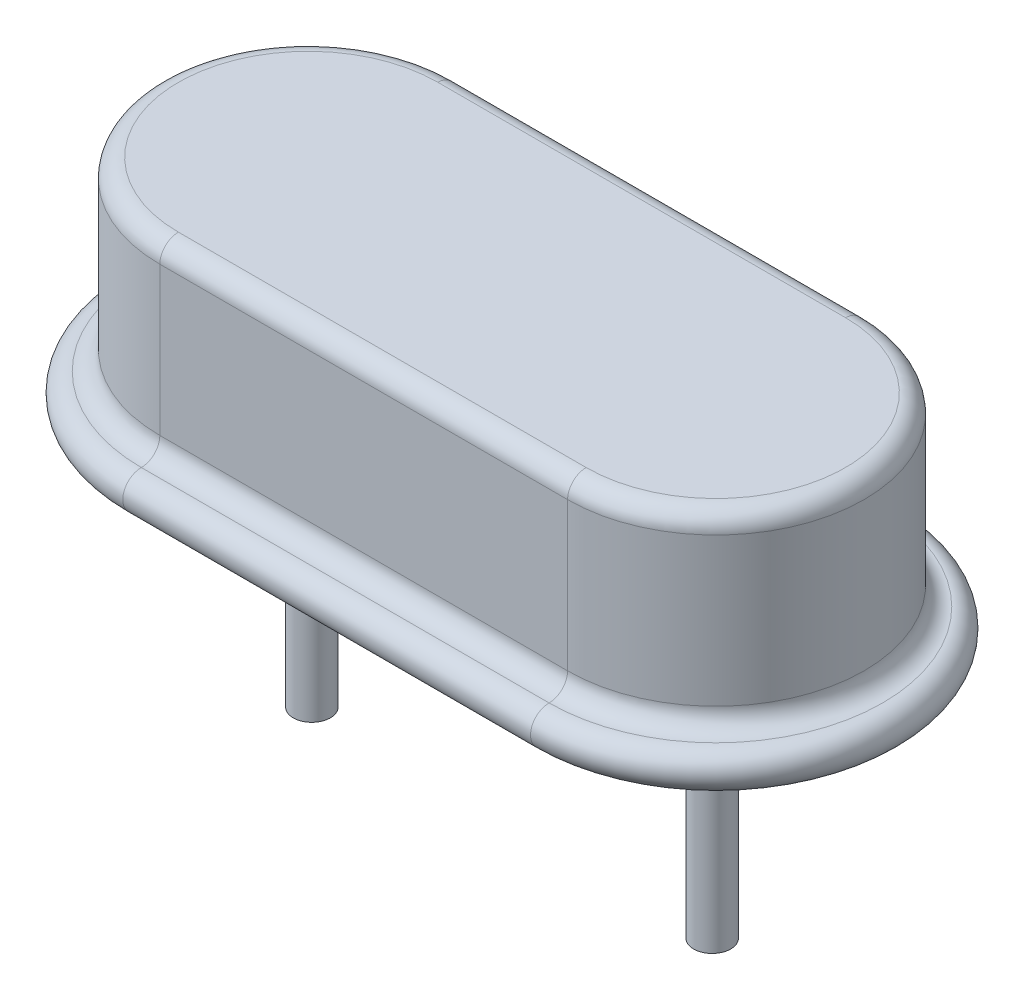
ISO-10303-21;
HEADER;
FILE_DESCRIPTION(('STEP AP214'),'2;1');
FILE_NAME('part.step','',(''),(''),'','','');
FILE_SCHEMA(('AUTOMOTIVE_DESIGN { 1 0 10303 214 1 1 1 1 }'));
ENDSEC;
DATA;
#1=APPLICATION_CONTEXT('core data for automotive mechanical design processes');
#2=APPLICATION_PROTOCOL_DEFINITION('international standard','automotive_design',2000,#1);
#3=PRODUCT_CONTEXT('',#1,'mechanical');
#4=PRODUCT('Part','Part','',(#3));
#5=PRODUCT_RELATED_PRODUCT_CATEGORY('part','',(#4));
#6=PRODUCT_DEFINITION_FORMATION('','',#4);
#7=PRODUCT_DEFINITION_CONTEXT('part definition',#1,'design');
#8=PRODUCT_DEFINITION('design','',#6,#7);
#9=PRODUCT_DEFINITION_SHAPE('','',#8);
#10=(LENGTH_UNIT() NAMED_UNIT(*) SI_UNIT(.MILLI.,.METRE.));
#11=(NAMED_UNIT(*) PLANE_ANGLE_UNIT() SI_UNIT($,.RADIAN.));
#12=(NAMED_UNIT(*) SI_UNIT($,.STERADIAN.) SOLID_ANGLE_UNIT());
#13=UNCERTAINTY_MEASURE_WITH_UNIT(LENGTH_MEASURE(1.E-05),#10,'distance_accuracy_value','');
#14=(GEOMETRIC_REPRESENTATION_CONTEXT(3) GLOBAL_UNCERTAINTY_ASSIGNED_CONTEXT((#13)) GLOBAL_UNIT_ASSIGNED_CONTEXT((#10,
#11,#12)) REPRESENTATION_CONTEXT('',''));
#15=CARTESIAN_POINT('',(0.,0.,0.));
#16=DIRECTION('',(0.,0.,1.));
#17=DIRECTION('',(1.,0.,0.));
#18=AXIS2_PLACEMENT_3D('',#15,#16,#17);
#19=CARTESIAN_POINT('',(0.,3.,0.));
#20=DIRECTION('',(0.,1.,0.));
#21=DIRECTION('',(0.,0.,1.));
#22=AXIS2_PLACEMENT_3D('',#19,#20,#21);
#23=PLANE('',#22);
#24=DIRECTION('',(-1.,0.,0.));
#25=VECTOR('',#24,1.);
#26=CARTESIAN_POINT('',(2.375,3.,-1.75));
#27=LINE('',#26,#25);
#28=CARTESIAN_POINT('',(-2.75,3.,-1.75));
#29=VERTEX_POINT('',#28);
#30=CARTESIAN_POINT('',(2.75,3.,-1.75));
#31=VERTEX_POINT('',#30);
#32=EDGE_CURVE('E112',#29,#31,#27,.F.);
#33=ORIENTED_EDGE('',*,*,#32,.F.);
#34=CARTESIAN_POINT('',(-2.75,3.,0.));
#35=DIRECTION('',(0.,-1.,0.));
#36=DIRECTION('',(0.,0.,1.));
#37=AXIS2_PLACEMENT_3D('',#34,#35,#36);
#38=CIRCLE('',#37,1.75);
#39=CARTESIAN_POINT('',(-2.75,3.,1.75));
#40=VERTEX_POINT('',#39);
#41=EDGE_CURVE('E94',#40,#29,#38,.T.);
#42=ORIENTED_EDGE('',*,*,#41,.F.);
#43=DIRECTION('',(1.,0.,0.));
#44=VECTOR('',#43,1.);
#45=CARTESIAN_POINT('',(-2.375,3.,1.75));
#46=LINE('',#45,#44);
#47=CARTESIAN_POINT('',(2.75,3.,1.75));
#48=VERTEX_POINT('',#47);
#49=EDGE_CURVE('E131',#48,#40,#46,.F.);
#50=ORIENTED_EDGE('',*,*,#49,.F.);
#51=CARTESIAN_POINT('',(2.75,3.,0.));
#52=DIRECTION('',(0.,-1.,0.));
#53=DIRECTION('',(0.,0.,-1.));
#54=AXIS2_PLACEMENT_3D('',#51,#52,#53);
#55=CIRCLE('',#54,1.75);
#56=EDGE_CURVE('E118',#31,#48,#55,.T.);
#57=ORIENTED_EDGE('',*,*,#56,.F.);
#58=EDGE_LOOP('',(#33,#42,#50,#57));
#59=FACE_BOUND('',#58,.T.);
#60=ADVANCED_FACE('F17',(#59),#23,.T.);
#61=CARTESIAN_POINT('',(-2.75,2.75,0.));
#62=DIRECTION('',(0.,-1.,0.));
#63=DIRECTION('',(0.,0.,-1.));
#64=AXIS2_PLACEMENT_3D('',#61,#62,#63);
#65=TOROIDAL_SURFACE('',#64,1.75,0.25);
#66=CARTESIAN_POINT('',(-2.75,2.75,1.75));
#67=DIRECTION('',(1.,0.,0.));
#68=DIRECTION('',(0.,0.,-1.));
#69=AXIS2_PLACEMENT_3D('',#66,#67,#68);
#70=CIRCLE('',#69,0.25);
#71=CARTESIAN_POINT('',(-2.75,2.75,2.));
#72=VERTEX_POINT('',#71);
#73=EDGE_CURVE('E101',#40,#72,#70,.T.);
#74=ORIENTED_EDGE('',*,*,#73,.F.);
#75=ORIENTED_EDGE('',*,*,#41,.T.);
#76=CARTESIAN_POINT('',(-2.75,2.75,-1.75));
#77=DIRECTION('',(-1.,0.,0.));
#78=DIRECTION('',(0.,0.,1.));
#79=AXIS2_PLACEMENT_3D('',#76,#77,#78);
#80=CIRCLE('',#79,0.25);
#81=CARTESIAN_POINT('',(-2.75,2.75,-2.));
#82=VERTEX_POINT('',#81);
#83=EDGE_CURVE('E99',#82,#29,#80,.F.);
#84=ORIENTED_EDGE('',*,*,#83,.F.);
#85=CARTESIAN_POINT('',(-2.75,2.75,0.));
#86=DIRECTION('',(0.,1.,0.));
#87=DIRECTION('',(0.,0.,1.));
#88=AXIS2_PLACEMENT_3D('',#85,#86,#87);
#89=CIRCLE('',#88,2.);
#90=EDGE_CURVE('E123',#72,#82,#89,.F.);
#91=ORIENTED_EDGE('',*,*,#90,.F.);
#92=EDGE_LOOP('',(#74,#75,#84,#91));
#93=FACE_BOUND('',#92,.T.);
#94=ADVANCED_FACE('F97',(#93),#65,.T.);
#95=CARTESIAN_POINT('',(-2.375,2.75,1.75));
#96=DIRECTION('',(1.,0.,0.));
#97=DIRECTION('',(0.,0.,-1.));
#98=AXIS2_PLACEMENT_3D('',#95,#96,#97);
#99=CYLINDRICAL_SURFACE('',#98,0.25);
#100=CARTESIAN_POINT('',(2.75,2.75,1.75));
#101=DIRECTION('',(-1.,0.,0.));
#102=DIRECTION('',(0.,0.,1.));
#103=AXIS2_PLACEMENT_3D('',#100,#101,#102);
#104=CIRCLE('',#103,0.25);
#105=CARTESIAN_POINT('',(2.75,2.75,2.));
#106=VERTEX_POINT('',#105);
#107=EDGE_CURVE('E116',#48,#106,#104,.F.);
#108=ORIENTED_EDGE('',*,*,#107,.F.);
#109=ORIENTED_EDGE('',*,*,#49,.T.);
#110=ORIENTED_EDGE('',*,*,#73,.T.);
#111=DIRECTION('',(1.,0.,0.));
#112=VECTOR('',#111,1.);
#113=CARTESIAN_POINT('',(-4.75,2.75,2.));
#114=LINE('',#113,#112);
#115=EDGE_CURVE('E317',#106,#72,#114,.F.);
#116=ORIENTED_EDGE('',*,*,#115,.F.);
#117=EDGE_LOOP('',(#108,#109,#110,#116));
#118=FACE_BOUND('',#117,.T.);
#119=ADVANCED_FACE('F150',(#118),#99,.T.);
#120=CARTESIAN_POINT('',(2.75,2.75,0.));
#121=DIRECTION('',(0.,-1.,0.));
#122=DIRECTION('',(0.,0.,-1.));
#123=AXIS2_PLACEMENT_3D('',#120,#121,#122);
#124=TOROIDAL_SURFACE('',#123,1.75,0.25);
#125=ORIENTED_EDGE('',*,*,#107,.T.);
#126=CARTESIAN_POINT('',(2.75,2.75,0.));
#127=DIRECTION('',(0.,1.,0.));
#128=DIRECTION('',(0.,0.,1.));
#129=AXIS2_PLACEMENT_3D('',#126,#127,#128);
#130=CIRCLE('',#129,2.);
#131=CARTESIAN_POINT('',(2.75,2.75,-2.));
#132=VERTEX_POINT('',#131);
#133=EDGE_CURVE('E312',#132,#106,#130,.F.);
#134=ORIENTED_EDGE('',*,*,#133,.F.);
#135=CARTESIAN_POINT('',(2.75,2.75,-1.75));
#136=DIRECTION('',(-1.,0.,0.));
#137=DIRECTION('',(0.,0.,1.));
#138=AXIS2_PLACEMENT_3D('',#135,#136,#137);
#139=CIRCLE('',#138,0.25);
#140=EDGE_CURVE('E121',#31,#132,#139,.T.);
#141=ORIENTED_EDGE('',*,*,#140,.F.);
#142=ORIENTED_EDGE('',*,*,#56,.T.);
#143=EDGE_LOOP('',(#125,#134,#141,#142));
#144=FACE_BOUND('',#143,.T.);
#145=ADVANCED_FACE('F139',(#144),#124,.T.);
#146=CARTESIAN_POINT('',(2.375,2.75,-1.75));
#147=DIRECTION('',(-1.,0.,0.));
#148=DIRECTION('',(0.,0.,1.));
#149=AXIS2_PLACEMENT_3D('',#146,#147,#148);
#150=CYLINDRICAL_SURFACE('',#149,0.25);
#151=ORIENTED_EDGE('',*,*,#140,.T.);
#152=DIRECTION('',(-1.,0.,0.));
#153=VECTOR('',#152,1.);
#154=CARTESIAN_POINT('',(4.75,2.75,-2.));
#155=LINE('',#154,#153);
#156=EDGE_CURVE('E115',#82,#132,#155,.F.);
#157=ORIENTED_EDGE('',*,*,#156,.F.);
#158=ORIENTED_EDGE('',*,*,#83,.T.);
#159=ORIENTED_EDGE('',*,*,#32,.T.);
#160=EDGE_LOOP('',(#151,#157,#158,#159));
#161=FACE_BOUND('',#160,.T.);
#162=ADVANCED_FACE('F111',(#161),#150,.T.);
#163=CARTESIAN_POINT('',(-2.75,0.,0.));
#164=DIRECTION('',(0.,1.,0.));
#165=DIRECTION('',(0.,0.,1.));
#166=AXIS2_PLACEMENT_3D('',#163,#164,#165);
#167=CYLINDRICAL_SURFACE('',#166,2.);
#168=CARTESIAN_POINT('',(-2.75,0.75,0.));
#169=DIRECTION('',(0.,1.,0.));
#170=DIRECTION('',(0.,0.,1.));
#171=AXIS2_PLACEMENT_3D('',#168,#169,#170);
#172=CIRCLE('',#171,2.);
#173=CARTESIAN_POINT('',(-2.75,0.75,-2.));
#174=VERTEX_POINT('',#173);
#175=CARTESIAN_POINT('',(-2.75,0.75,2.));
#176=VERTEX_POINT('',#175);
#177=EDGE_CURVE('E293',#174,#176,#172,.T.);
#178=ORIENTED_EDGE('',*,*,#177,.T.);
#179=DIRECTION('',(0.,1.,0.));
#180=VECTOR('',#179,1.);
#181=CARTESIAN_POINT('',(-2.75,0.,2.));
#182=LINE('',#181,#180);
#183=EDGE_CURVE('E315',#72,#176,#182,.F.);
#184=ORIENTED_EDGE('',*,*,#183,.F.);
#185=ORIENTED_EDGE('',*,*,#90,.T.);
#186=DIRECTION('',(0.,1.,0.));
#187=VECTOR('',#186,1.);
#188=CARTESIAN_POINT('',(-2.75,0.,-2.));
#189=LINE('',#188,#187);
#190=EDGE_CURVE('E296',#174,#82,#189,.T.);
#191=ORIENTED_EDGE('',*,*,#190,.F.);
#192=EDGE_LOOP('',(#178,#184,#185,#191));
#193=FACE_BOUND('',#192,.T.);
#194=ADVANCED_FACE('F350',(#193),#167,.T.);
#195=CARTESIAN_POINT('',(-4.75,0.,2.));
#196=DIRECTION('',(0.,0.,1.));
#197=DIRECTION('',(1.,0.,0.));
#198=AXIS2_PLACEMENT_3D('',#195,#196,#197);
#199=PLANE('',#198);
#200=DIRECTION('',(1.,0.,0.));
#201=VECTOR('',#200,1.);
#202=CARTESIAN_POINT('',(-2.375,0.75,2.));
#203=LINE('',#202,#201);
#204=CARTESIAN_POINT('',(2.75,0.75,2.));
#205=VERTEX_POINT('',#204);
#206=EDGE_CURVE('E282',#176,#205,#203,.T.);
#207=ORIENTED_EDGE('',*,*,#206,.T.);
#208=DIRECTION('',(0.,1.,0.));
#209=VECTOR('',#208,1.);
#210=CARTESIAN_POINT('',(2.75,0.,2.));
#211=LINE('',#210,#209);
#212=EDGE_CURVE('E310',#106,#205,#211,.F.);
#213=ORIENTED_EDGE('',*,*,#212,.F.);
#214=ORIENTED_EDGE('',*,*,#115,.T.);
#215=ORIENTED_EDGE('',*,*,#183,.T.);
#216=EDGE_LOOP('',(#207,#213,#214,#215));
#217=FACE_BOUND('',#216,.T.);
#218=ADVANCED_FACE('F345',(#217),#199,.T.);
#219=CARTESIAN_POINT('',(2.75,0.,0.));
#220=DIRECTION('',(0.,1.,0.));
#221=DIRECTION('',(0.,0.,1.));
#222=AXIS2_PLACEMENT_3D('',#219,#220,#221);
#223=CYLINDRICAL_SURFACE('',#222,2.);
#224=CARTESIAN_POINT('',(2.75,0.75,0.));
#225=DIRECTION('',(0.,1.,0.));
#226=DIRECTION('',(0.,0.,1.));
#227=AXIS2_PLACEMENT_3D('',#224,#225,#226);
#228=CIRCLE('',#227,2.);
#229=CARTESIAN_POINT('',(2.75,0.75,-2.));
#230=VERTEX_POINT('',#229);
#231=EDGE_CURVE('E276',#205,#230,#228,.T.);
#232=ORIENTED_EDGE('',*,*,#231,.T.);
#233=DIRECTION('',(0.,1.,0.));
#234=VECTOR('',#233,1.);
#235=CARTESIAN_POINT('',(2.75,0.,-2.));
#236=LINE('',#235,#234);
#237=EDGE_CURVE('E299',#132,#230,#236,.F.);
#238=ORIENTED_EDGE('',*,*,#237,.F.);
#239=ORIENTED_EDGE('',*,*,#133,.T.);
#240=ORIENTED_EDGE('',*,*,#212,.T.);
#241=EDGE_LOOP('',(#232,#238,#239,#240));
#242=FACE_BOUND('',#241,.T.);
#243=ADVANCED_FACE('F392',(#242),#223,.T.);
#244=CARTESIAN_POINT('',(4.75,0.,-2.));
#245=DIRECTION('',(0.,0.,-1.));
#246=DIRECTION('',(-1.,0.,0.));
#247=AXIS2_PLACEMENT_3D('',#244,#245,#246);
#248=PLANE('',#247);
#249=DIRECTION('',(-1.,0.,0.));
#250=VECTOR('',#249,1.);
#251=CARTESIAN_POINT('',(2.375,0.75,-2.));
#252=LINE('',#251,#250);
#253=EDGE_CURVE('E253',#230,#174,#252,.T.);
#254=ORIENTED_EDGE('',*,*,#253,.T.);
#255=ORIENTED_EDGE('',*,*,#190,.T.);
#256=ORIENTED_EDGE('',*,*,#156,.T.);
#257=ORIENTED_EDGE('',*,*,#237,.T.);
#258=EDGE_LOOP('',(#254,#255,#256,#257));
#259=FACE_BOUND('',#258,.T.);
#260=ADVANCED_FACE('F168',(#259),#248,.T.);
#261=CARTESIAN_POINT('',(-2.75,0.75,0.));
#262=DIRECTION('',(0.,1.,0.));
#263=DIRECTION('',(0.,0.,1.));
#264=AXIS2_PLACEMENT_3D('',#261,#262,#263);
#265=TOROIDAL_SURFACE('',#264,2.25,0.25);
#266=CARTESIAN_POINT('',(-2.75,0.5,0.));
#267=DIRECTION('',(0.,1.,0.));
#268=DIRECTION('',(0.,0.,1.));
#269=AXIS2_PLACEMENT_3D('',#266,#267,#268);
#270=CIRCLE('',#269,2.25);
#271=CARTESIAN_POINT('',(-2.75,0.5,2.25));
#272=VERTEX_POINT('',#271);
#273=CARTESIAN_POINT('',(-2.75,0.5,-2.25));
#274=VERTEX_POINT('',#273);
#275=EDGE_CURVE('E240',#272,#274,#270,.F.);
#276=ORIENTED_EDGE('',*,*,#275,.F.);
#277=CARTESIAN_POINT('',(-2.75,0.75,2.25));
#278=DIRECTION('',(1.,0.,0.));
#279=DIRECTION('',(0.,0.,-1.));
#280=AXIS2_PLACEMENT_3D('',#277,#278,#279);
#281=CIRCLE('',#280,0.25);
#282=EDGE_CURVE('E279',#272,#176,#281,.T.);
#283=ORIENTED_EDGE('',*,*,#282,.T.);
#284=ORIENTED_EDGE('',*,*,#177,.F.);
#285=CARTESIAN_POINT('',(-2.75,0.75,-2.25));
#286=DIRECTION('',(-1.,0.,0.));
#287=DIRECTION('',(0.,0.,1.));
#288=AXIS2_PLACEMENT_3D('',#285,#286,#287);
#289=CIRCLE('',#288,0.25);
#290=EDGE_CURVE('E250',#174,#274,#289,.F.);
#291=ORIENTED_EDGE('',*,*,#290,.T.);
#292=EDGE_LOOP('',(#276,#283,#284,#291));
#293=FACE_BOUND('',#292,.T.);
#294=ADVANCED_FACE('F163',(#293),#265,.F.);
#295=CARTESIAN_POINT('',(-2.375,0.75,2.25));
#296=DIRECTION('',(1.,0.,0.));
#297=DIRECTION('',(0.,0.,-1.));
#298=AXIS2_PLACEMENT_3D('',#295,#296,#297);
#299=CYLINDRICAL_SURFACE('',#298,0.25);
#300=DIRECTION('',(1.,0.,0.));
#301=VECTOR('',#300,1.);
#302=CARTESIAN_POINT('',(-2.625,0.5,2.25));
#303=LINE('',#302,#301);
#304=CARTESIAN_POINT('',(2.75,0.5,2.25));
#305=VERTEX_POINT('',#304);
#306=EDGE_CURVE('E230',#305,#272,#303,.F.);
#307=ORIENTED_EDGE('',*,*,#306,.F.);
#308=CARTESIAN_POINT('',(2.75,0.75,2.25));
#309=DIRECTION('',(1.,0.,0.));
#310=DIRECTION('',(0.,0.,1.));
#311=AXIS2_PLACEMENT_3D('',#308,#309,#310);
#312=CIRCLE('',#311,0.25);
#313=EDGE_CURVE('E273',#305,#205,#312,.T.);
#314=ORIENTED_EDGE('',*,*,#313,.T.);
#315=ORIENTED_EDGE('',*,*,#206,.F.);
#316=ORIENTED_EDGE('',*,*,#282,.F.);
#317=EDGE_LOOP('',(#307,#314,#315,#316));
#318=FACE_BOUND('',#317,.T.);
#319=ADVANCED_FACE('F167',(#318),#299,.F.);
#320=CARTESIAN_POINT('',(2.75,0.75,0.));
#321=DIRECTION('',(0.,1.,0.));
#322=DIRECTION('',(0.,0.,1.));
#323=AXIS2_PLACEMENT_3D('',#320,#321,#322);
#324=TOROIDAL_SURFACE('',#323,2.25,0.25);
#325=CARTESIAN_POINT('',(2.75,0.5,0.));
#326=DIRECTION('',(0.,1.,0.));
#327=DIRECTION('',(0.,0.,1.));
#328=AXIS2_PLACEMENT_3D('',#325,#326,#327);
#329=CIRCLE('',#328,2.25);
#330=CARTESIAN_POINT('',(2.75,0.5,-2.25));
#331=VERTEX_POINT('',#330);
#332=EDGE_CURVE('E225',#331,#305,#329,.F.);
#333=ORIENTED_EDGE('',*,*,#332,.F.);
#334=CARTESIAN_POINT('',(2.75,0.75,-2.25));
#335=DIRECTION('',(-1.,0.,0.));
#336=DIRECTION('',(0.,0.,1.));
#337=AXIS2_PLACEMENT_3D('',#334,#335,#336);
#338=CIRCLE('',#337,0.25);
#339=EDGE_CURVE('E247',#331,#230,#338,.T.);
#340=ORIENTED_EDGE('',*,*,#339,.T.);
#341=ORIENTED_EDGE('',*,*,#231,.F.);
#342=ORIENTED_EDGE('',*,*,#313,.F.);
#343=EDGE_LOOP('',(#333,#340,#341,#342));
#344=FACE_BOUND('',#343,.T.);
#345=ADVANCED_FACE('F173',(#344),#324,.F.);
#346=CARTESIAN_POINT('',(2.375,0.75,-2.25));
#347=DIRECTION('',(-1.,0.,0.));
#348=DIRECTION('',(0.,0.,1.));
#349=AXIS2_PLACEMENT_3D('',#346,#347,#348);
#350=CYLINDRICAL_SURFACE('',#349,0.25);
#351=DIRECTION('',(-1.,0.,0.));
#352=VECTOR('',#351,1.);
#353=CARTESIAN_POINT('',(2.625,0.5,-2.25));
#354=LINE('',#353,#352);
#355=EDGE_CURVE('E256',#274,#331,#354,.F.);
#356=ORIENTED_EDGE('',*,*,#355,.F.);
#357=ORIENTED_EDGE('',*,*,#290,.F.);
#358=ORIENTED_EDGE('',*,*,#253,.F.);
#359=ORIENTED_EDGE('',*,*,#339,.F.);
#360=EDGE_LOOP('',(#356,#357,#358,#359));
#361=FACE_BOUND('',#360,.T.);
#362=ADVANCED_FACE('F177',(#361),#350,.F.);
#363=CARTESIAN_POINT('',(2.7,-3.4,0.));
#364=DIRECTION('',(0.,-1.,0.));
#365=DIRECTION('',(0.,0.,-1.));
#366=AXIS2_PLACEMENT_3D('',#363,#364,#365);
#367=PLANE('',#366);
#368=CARTESIAN_POINT('',(2.7,-3.4,0.));
#369=DIRECTION('',(0.,-1.,0.));
#370=DIRECTION('',(0.,0.,-1.));
#371=AXIS2_PLACEMENT_3D('',#368,#369,#370);
#372=CIRCLE('',#371,0.25);
#373=CARTESIAN_POINT('',(2.7,-3.4,-0.25));
#374=VERTEX_POINT('',#373);
#375=EDGE_CURVE('E22',#374,#374,#372,.F.);
#376=ORIENTED_EDGE('',*,*,#375,.F.);
#377=EDGE_LOOP('',(#376));
#378=FACE_BOUND('',#377,.T.);
#379=ADVANCED_FACE('F181',(#378),#367,.T.);
#380=CARTESIAN_POINT('',(-2.7,-3.4,0.));
#381=DIRECTION('',(0.,-1.,0.));
#382=DIRECTION('',(0.,0.,-1.));
#383=AXIS2_PLACEMENT_3D('',#380,#381,#382);
#384=PLANE('',#383);
#385=CARTESIAN_POINT('',(-2.7,-3.4,0.));
#386=DIRECTION('',(0.,-1.,0.));
#387=DIRECTION('',(0.,0.,-1.));
#388=AXIS2_PLACEMENT_3D('',#385,#386,#387);
#389=CIRCLE('',#388,0.25);
#390=CARTESIAN_POINT('',(-2.7,-3.4,-0.25));
#391=VERTEX_POINT('',#390);
#392=EDGE_CURVE('E414',#391,#391,#389,.F.);
#393=ORIENTED_EDGE('',*,*,#392,.F.);
#394=EDGE_LOOP('',(#393));
#395=FACE_BOUND('',#394,.T.);
#396=ADVANCED_FACE('F185',(#395),#384,.T.);
#397=CARTESIAN_POINT('',(-2.75,0.25,0.));
#398=DIRECTION('',(0.,1.,0.));
#399=DIRECTION('',(0.,0.,1.));
#400=AXIS2_PLACEMENT_3D('',#397,#398,#399);
#401=TOROIDAL_SURFACE('',#400,2.25,0.25);
#402=CARTESIAN_POINT('',(-2.75,0.25,-2.25));
#403=DIRECTION('',(-1.,0.,0.));
#404=DIRECTION('',(0.,0.,1.));
#405=AXIS2_PLACEMENT_3D('',#402,#403,#404);
#406=CIRCLE('',#405,0.25);
#407=CARTESIAN_POINT('',(-2.75,0.,-2.25));
#408=VERTEX_POINT('',#407);
#409=EDGE_CURVE('E258',#408,#274,#406,.F.);
#410=ORIENTED_EDGE('',*,*,#409,.F.);
#411=CARTESIAN_POINT('',(-2.75,0.,0.));
#412=DIRECTION('',(0.,1.,0.));
#413=DIRECTION('',(0.,0.,-1.));
#414=AXIS2_PLACEMENT_3D('',#411,#412,#413);
#415=CIRCLE('',#414,2.25);
#416=CARTESIAN_POINT('',(-2.75,0.,2.25));
#417=VERTEX_POINT('',#416);
#418=EDGE_CURVE('E236',#408,#417,#415,.T.);
#419=ORIENTED_EDGE('',*,*,#418,.T.);
#420=CARTESIAN_POINT('',(-2.75,0.25,2.25));
#421=DIRECTION('',(1.,0.,0.));
#422=DIRECTION('',(0.,0.,-1.));
#423=AXIS2_PLACEMENT_3D('',#420,#421,#422);
#424=CIRCLE('',#423,0.25);
#425=EDGE_CURVE('E228',#272,#417,#424,.T.);
#426=ORIENTED_EDGE('',*,*,#425,.F.);
#427=ORIENTED_EDGE('',*,*,#275,.T.);
#428=EDGE_LOOP('',(#410,#419,#426,#427));
#429=FACE_BOUND('',#428,.T.);
#430=ADVANCED_FACE('F189',(#429),#401,.T.);
#431=CARTESIAN_POINT('',(-2.625,0.25,2.25));
#432=DIRECTION('',(1.,0.,0.));
#433=DIRECTION('',(0.,0.,-1.));
#434=AXIS2_PLACEMENT_3D('',#431,#432,#433);
#435=CYLINDRICAL_SURFACE('',#434,0.25);
#436=ORIENTED_EDGE('',*,*,#425,.T.);
#437=DIRECTION('',(1.,0.,0.));
#438=VECTOR('',#437,1.);
#439=CARTESIAN_POINT('',(0.,0.,2.25));
#440=LINE('',#439,#438);
#441=CARTESIAN_POINT('',(2.75,0.,2.25));
#442=VERTEX_POINT('',#441);
#443=EDGE_CURVE('E358',#417,#442,#440,.T.);
#444=ORIENTED_EDGE('',*,*,#443,.T.);
#445=CARTESIAN_POINT('',(2.75,0.25,2.25));
#446=DIRECTION('',(1.,0.,0.));
#447=DIRECTION('',(0.,0.,1.));
#448=AXIS2_PLACEMENT_3D('',#445,#446,#447);
#449=CIRCLE('',#448,0.25);
#450=EDGE_CURVE('E218',#305,#442,#449,.T.);
#451=ORIENTED_EDGE('',*,*,#450,.F.);
#452=ORIENTED_EDGE('',*,*,#306,.T.);
#453=EDGE_LOOP('',(#436,#444,#451,#452));
#454=FACE_BOUND('',#453,.T.);
#455=ADVANCED_FACE('F194',(#454),#435,.T.);
#456=CARTESIAN_POINT('',(2.75,0.25,0.));
#457=DIRECTION('',(0.,1.,0.));
#458=DIRECTION('',(0.,0.,1.));
#459=AXIS2_PLACEMENT_3D('',#456,#457,#458);
#460=TOROIDAL_SURFACE('',#459,2.25,0.25);
#461=ORIENTED_EDGE('',*,*,#450,.T.);
#462=CARTESIAN_POINT('',(2.75,0.,0.));
#463=DIRECTION('',(0.,1.,0.));
#464=DIRECTION('',(0.,0.,1.));
#465=AXIS2_PLACEMENT_3D('',#462,#463,#464);
#466=CIRCLE('',#465,2.25);
#467=CARTESIAN_POINT('',(2.75,0.,-2.25));
#468=VERTEX_POINT('',#467);
#469=EDGE_CURVE('E360',#442,#468,#466,.T.);
#470=ORIENTED_EDGE('',*,*,#469,.T.);
#471=CARTESIAN_POINT('',(2.75,0.25,-2.25));
#472=DIRECTION('',(-1.,0.,0.));
#473=DIRECTION('',(0.,0.,1.));
#474=AXIS2_PLACEMENT_3D('',#471,#472,#473);
#475=CIRCLE('',#474,0.25);
#476=EDGE_CURVE('E37',#331,#468,#475,.T.);
#477=ORIENTED_EDGE('',*,*,#476,.F.);
#478=ORIENTED_EDGE('',*,*,#332,.T.);
#479=EDGE_LOOP('',(#461,#470,#477,#478));
#480=FACE_BOUND('',#479,.T.);
#481=ADVANCED_FACE('F204',(#480),#460,.T.);
#482=CARTESIAN_POINT('',(2.625,0.25,-2.25));
#483=DIRECTION('',(-1.,0.,0.));
#484=DIRECTION('',(0.,0.,1.));
#485=AXIS2_PLACEMENT_3D('',#482,#483,#484);
#486=CYLINDRICAL_SURFACE('',#485,0.25);
#487=ORIENTED_EDGE('',*,*,#409,.T.);
#488=ORIENTED_EDGE('',*,*,#355,.T.);
#489=ORIENTED_EDGE('',*,*,#476,.T.);
#490=DIRECTION('',(1.,0.,0.));
#491=VECTOR('',#490,1.);
#492=CARTESIAN_POINT('',(0.,0.,-2.25));
#493=LINE('',#492,#491);
#494=EDGE_CURVE('E364',#468,#408,#493,.F.);
#495=ORIENTED_EDGE('',*,*,#494,.T.);
#496=EDGE_LOOP('',(#487,#488,#489,#495));
#497=FACE_BOUND('',#496,.T.);
#498=ADVANCED_FACE('F208',(#497),#486,.T.);
#499=CARTESIAN_POINT('',(2.7,0.,0.));
#500=DIRECTION('',(0.,-1.,0.));
#501=DIRECTION('',(0.,0.,-1.));
#502=AXIS2_PLACEMENT_3D('',#499,#500,#501);
#503=CYLINDRICAL_SURFACE('',#502,0.25);
#504=CARTESIAN_POINT('',(2.7,0.,0.));
#505=DIRECTION('',(0.,-1.,0.));
#506=DIRECTION('',(0.,0.,-1.));
#507=AXIS2_PLACEMENT_3D('',#504,#505,#506);
#508=CIRCLE('',#507,0.25);
#509=CARTESIAN_POINT('',(2.7,0.,-0.25));
#510=VERTEX_POINT('',#509);
#511=EDGE_CURVE('E28',#510,#510,#508,.T.);
#512=ORIENTED_EDGE('',*,*,#511,.T.);
#513=EDGE_LOOP('',(#512));
#514=FACE_BOUND('',#513,.T.);
#515=ORIENTED_EDGE('',*,*,#375,.T.);
#516=EDGE_LOOP('',(#515));
#517=FACE_BOUND('',#516,.T.);
#518=ADVANCED_FACE('F406',(#514,#517),#503,.T.);
#519=CARTESIAN_POINT('',(-2.7,0.,0.));
#520=DIRECTION('',(0.,-1.,0.));
#521=DIRECTION('',(0.,0.,-1.));
#522=AXIS2_PLACEMENT_3D('',#519,#520,#521);
#523=CYLINDRICAL_SURFACE('',#522,0.25);
#524=CARTESIAN_POINT('',(-2.7,0.,0.));
#525=DIRECTION('',(0.,-1.,0.));
#526=DIRECTION('',(0.,0.,-1.));
#527=AXIS2_PLACEMENT_3D('',#524,#525,#526);
#528=CIRCLE('',#527,0.25);
#529=CARTESIAN_POINT('',(-2.7,0.,-0.25));
#530=VERTEX_POINT('',#529);
#531=EDGE_CURVE('E11',#530,#530,#528,.T.);
#532=ORIENTED_EDGE('',*,*,#531,.T.);
#533=EDGE_LOOP('',(#532));
#534=FACE_BOUND('',#533,.T.);
#535=ORIENTED_EDGE('',*,*,#392,.T.);
#536=EDGE_LOOP('',(#535));
#537=FACE_BOUND('',#536,.T.);
#538=ADVANCED_FACE('F401',(#534,#537),#523,.T.);
#539=CARTESIAN_POINT('',(0.,0.,0.));
#540=DIRECTION('',(0.,1.,0.));
#541=DIRECTION('',(0.,0.,1.));
#542=AXIS2_PLACEMENT_3D('',#539,#540,#541);
#543=PLANE('',#542);
#544=ORIENTED_EDGE('',*,*,#531,.F.);
#545=EDGE_LOOP('',(#544));
#546=FACE_BOUND('',#545,.T.);
#547=ORIENTED_EDGE('',*,*,#511,.F.);
#548=EDGE_LOOP('',(#547));
#549=FACE_BOUND('',#548,.T.);
#550=ORIENTED_EDGE('',*,*,#469,.F.);
#551=ORIENTED_EDGE('',*,*,#443,.F.);
#552=ORIENTED_EDGE('',*,*,#418,.F.);
#553=ORIENTED_EDGE('',*,*,#494,.F.);
#554=EDGE_LOOP('',(#550,#551,#552,#553));
#555=FACE_BOUND('',#554,.T.);
#556=ADVANCED_FACE('F19',(#546,#549,#555),#543,.F.);
#557=CLOSED_SHELL('',(#60,#94,#119,#145,#162,#194,#218,#243,#260,#294,#319,#345,#362,#379,#396,
#430,#455,#481,#498,#518,#538,#556));
#558=MANIFOLD_SOLID_BREP('B1',#557);
#559=ADVANCED_BREP_SHAPE_REPRESENTATION('',(#18,#558),#14);
#560=SHAPE_DEFINITION_REPRESENTATION(#9,#559);
ENDSEC;
END-ISO-10303-21;
